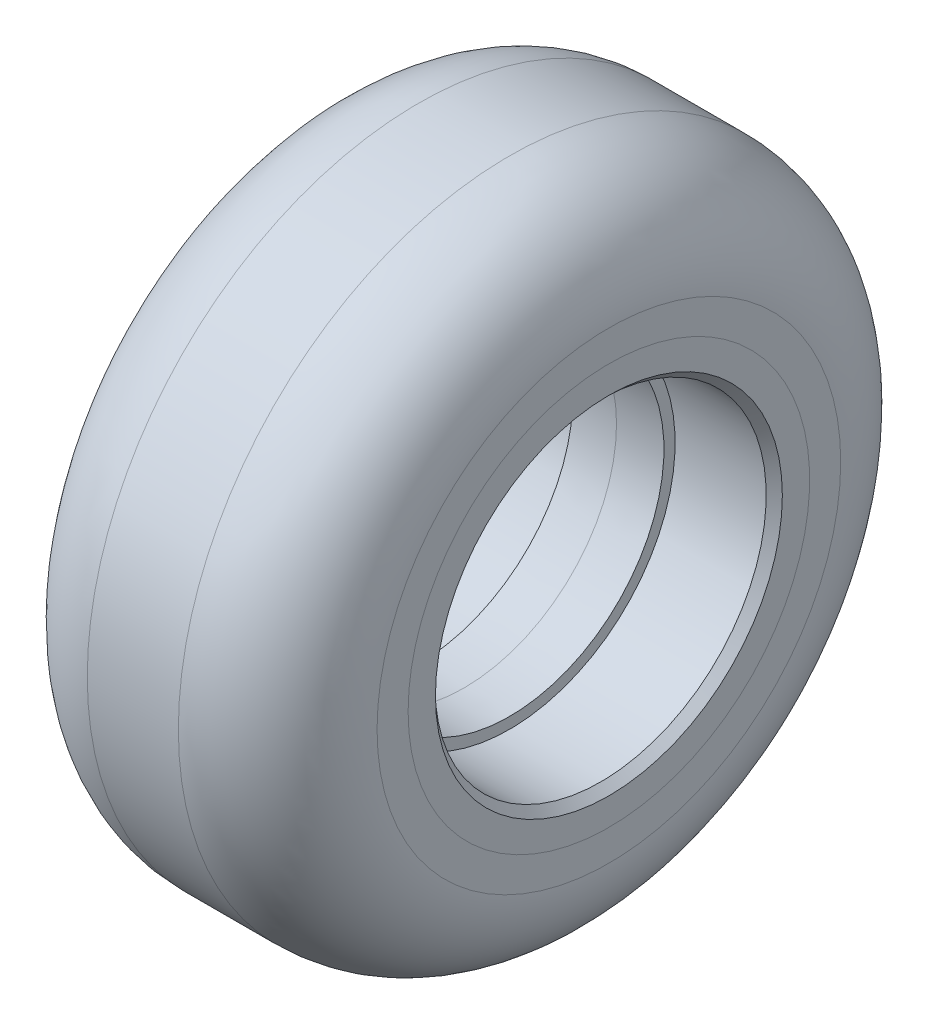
ISO-10303-21;
HEADER;
FILE_DESCRIPTION(('STEP AP214'),'2;1');
FILE_NAME('part.step','',(''),(''),'','','');
FILE_SCHEMA(('AUTOMOTIVE_DESIGN { 1 0 10303 214 1 1 1 1 }'));
ENDSEC;
DATA;
#1=APPLICATION_CONTEXT('core data for automotive mechanical design processes');
#2=APPLICATION_PROTOCOL_DEFINITION('international standard','automotive_design',2000,#1);
#3=PRODUCT_CONTEXT('',#1,'mechanical');
#4=PRODUCT('Part','Part','',(#3));
#5=PRODUCT_RELATED_PRODUCT_CATEGORY('part','',(#4));
#6=PRODUCT_DEFINITION_FORMATION('','',#4);
#7=PRODUCT_DEFINITION_CONTEXT('part definition',#1,'design');
#8=PRODUCT_DEFINITION('design','',#6,#7);
#9=PRODUCT_DEFINITION_SHAPE('','',#8);
#10=(LENGTH_UNIT() NAMED_UNIT(*) SI_UNIT(.MILLI.,.METRE.));
#11=(NAMED_UNIT(*) PLANE_ANGLE_UNIT() SI_UNIT($,.RADIAN.));
#12=(NAMED_UNIT(*) SI_UNIT($,.STERADIAN.) SOLID_ANGLE_UNIT());
#13=UNCERTAINTY_MEASURE_WITH_UNIT(LENGTH_MEASURE(1.E-05),#10,'distance_accuracy_value','');
#14=(GEOMETRIC_REPRESENTATION_CONTEXT(3) GLOBAL_UNCERTAINTY_ASSIGNED_CONTEXT((#13)) GLOBAL_UNIT_ASSIGNED_CONTEXT((#10,
#11,#12)) REPRESENTATION_CONTEXT('',''));
#15=CARTESIAN_POINT('',(0.,0.,0.));
#16=DIRECTION('',(0.,0.,1.));
#17=DIRECTION('',(1.,0.,0.));
#18=AXIS2_PLACEMENT_3D('',#15,#16,#17);
#19=CARTESIAN_POINT('',(-5.50000000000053,0.,0.));
#20=DIRECTION('',(-1.,0.,0.));
#21=DIRECTION('',(0.,0.,1.));
#22=AXIS2_PLACEMENT_3D('',#19,#20,#21);
#23=TOROIDAL_SURFACE('',#22,28.,12.);
#24=CARTESIAN_POINT('',(-17.5000000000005,0.,-1.014197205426E-13));
#25=DIRECTION('',(-1.,0.,0.));
#26=DIRECTION('',(0.,0.,1.));
#27=AXIS2_PLACEMENT_3D('',#24,#25,#26);
#28=CIRCLE('',#27,28.);
#29=CARTESIAN_POINT('',(-17.5000000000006,0.,27.9999999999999));
#30=VERTEX_POINT('',#29);
#31=EDGE_CURVE('E11',#30,#30,#28,.T.);
#32=ORIENTED_EDGE('',*,*,#31,.F.);
#33=EDGE_LOOP('',(#32));
#34=FACE_BOUND('',#33,.T.);
#35=CARTESIAN_POINT('',(-5.50000000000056,0.,0.));
#36=DIRECTION('',(-1.,0.,0.));
#37=DIRECTION('',(0.,0.,1.));
#38=AXIS2_PLACEMENT_3D('',#35,#36,#37);
#39=CIRCLE('',#38,40.);
#40=CARTESIAN_POINT('',(-5.50000000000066,0.,40.));
#41=VERTEX_POINT('',#40);
#42=EDGE_CURVE('E70',#41,#41,#39,.T.);
#43=ORIENTED_EDGE('',*,*,#42,.T.);
#44=EDGE_LOOP('',(#43));
#45=FACE_BOUND('',#44,.T.);
#46=ADVANCED_FACE('F45',(#34,#45),#23,.T.);
#47=CARTESIAN_POINT('',(-17.5000000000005,0.,-24.25));
#48=DIRECTION('',(1.,0.,0.));
#49=DIRECTION('',(0.,0.,-1.));
#50=AXIS2_PLACEMENT_3D('',#47,#48,#49);
#51=PLANE('',#50);
#52=CARTESIAN_POINT('',(-17.5000000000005,0.,-1.014197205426E-13));
#53=DIRECTION('',(-1.,0.,0.));
#54=DIRECTION('',(0.,0.,1.));
#55=AXIS2_PLACEMENT_3D('',#52,#53,#54);
#56=CIRCLE('',#55,24.2499999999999);
#57=CARTESIAN_POINT('',(-17.5000000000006,0.,24.2499999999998));
#58=VERTEX_POINT('',#57);
#59=EDGE_CURVE('E51',#58,#58,#56,.T.);
#60=ORIENTED_EDGE('',*,*,#59,.F.);
#61=EDGE_LOOP('',(#60));
#62=FACE_BOUND('',#61,.T.);
#63=ORIENTED_EDGE('',*,*,#31,.T.);
#64=EDGE_LOOP('',(#63));
#65=FACE_BOUND('',#64,.T.);
#66=ADVANCED_FACE('F101',(#62,#65),#51,.F.);
#67=CARTESIAN_POINT('',(-17.5000000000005,0.,-1.014197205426E-13));
#68=DIRECTION('',(1.,0.,0.));
#69=DIRECTION('',(0.,0.,-1.));
#70=AXIS2_PLACEMENT_3D('',#67,#68,#69);
#71=CONICAL_SURFACE('',#70,24.2499999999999,0.0428309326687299);
#72=CARTESIAN_POINT('',(-5.16947595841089E-13,0.,0.));
#73=DIRECTION('',(-1.,0.,0.));
#74=DIRECTION('',(0.,0.,1.));
#75=AXIS2_PLACEMENT_3D('',#72,#73,#74);
#76=CIRCLE('',#75,24.9999999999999);
#77=CARTESIAN_POINT('',(-5.80628026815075E-13,0.,24.9999999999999));
#78=VERTEX_POINT('',#77);
#79=EDGE_CURVE('E55',#78,#78,#76,.T.);
#80=ORIENTED_EDGE('',*,*,#79,.F.);
#81=EDGE_LOOP('',(#80));
#82=FACE_BOUND('',#81,.T.);
#83=ORIENTED_EDGE('',*,*,#59,.T.);
#84=EDGE_LOOP('',(#83));
#85=FACE_BOUND('',#84,.T.);
#86=ADVANCED_FACE('F96',(#82,#85),#71,.F.);
#87=CARTESIAN_POINT('',(-5.16947595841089E-13,0.,0.));
#88=DIRECTION('',(-1.,0.,0.));
#89=DIRECTION('',(0.,0.,1.));
#90=AXIS2_PLACEMENT_3D('',#87,#88,#89);
#91=CONICAL_SURFACE('',#90,24.9999999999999,0.042830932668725);
#92=CARTESIAN_POINT('',(17.4999999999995,0.,0.));
#93=DIRECTION('',(-1.,0.,0.));
#94=DIRECTION('',(0.,0.,1.));
#95=AXIS2_PLACEMENT_3D('',#92,#93,#94);
#96=CIRCLE('',#95,24.25);
#97=CARTESIAN_POINT('',(17.4999999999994,0.,24.25));
#98=VERTEX_POINT('',#97);
#99=EDGE_CURVE('E59',#98,#98,#96,.T.);
#100=ORIENTED_EDGE('',*,*,#99,.F.);
#101=EDGE_LOOP('',(#100));
#102=FACE_BOUND('',#101,.T.);
#103=ORIENTED_EDGE('',*,*,#79,.T.);
#104=EDGE_LOOP('',(#103));
#105=FACE_BOUND('',#104,.T.);
#106=ADVANCED_FACE('F90',(#102,#105),#91,.F.);
#107=CARTESIAN_POINT('',(17.4999999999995,0.,-24.25));
#108=DIRECTION('',(-1.,0.,0.));
#109=DIRECTION('',(0.,0.,1.));
#110=AXIS2_PLACEMENT_3D('',#107,#108,#109);
#111=PLANE('',#110);
#112=CARTESIAN_POINT('',(17.4999999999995,0.,0.));
#113=DIRECTION('',(-1.,0.,0.));
#114=DIRECTION('',(0.,0.,1.));
#115=AXIS2_PLACEMENT_3D('',#112,#113,#114);
#116=CIRCLE('',#115,28.0000000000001);
#117=CARTESIAN_POINT('',(17.4999999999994,0.,28.0000000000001));
#118=VERTEX_POINT('',#117);
#119=EDGE_CURVE('E64',#118,#118,#116,.T.);
#120=ORIENTED_EDGE('',*,*,#119,.F.);
#121=EDGE_LOOP('',(#120));
#122=FACE_BOUND('',#121,.T.);
#123=ORIENTED_EDGE('',*,*,#99,.T.);
#124=EDGE_LOOP('',(#123));
#125=FACE_BOUND('',#124,.T.);
#126=ADVANCED_FACE('F84',(#122,#125),#111,.F.);
#127=CARTESIAN_POINT('',(5.49999999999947,0.,0.));
#128=DIRECTION('',(-1.,0.,0.));
#129=DIRECTION('',(0.,0.,1.));
#130=AXIS2_PLACEMENT_3D('',#127,#128,#129);
#131=TOROIDAL_SURFACE('',#130,28.0000000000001,12.);
#132=CARTESIAN_POINT('',(5.49999999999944,0.,0.));
#133=DIRECTION('',(-1.,0.,0.));
#134=DIRECTION('',(0.,0.,1.));
#135=AXIS2_PLACEMENT_3D('',#132,#133,#134);
#136=CIRCLE('',#135,40.0000000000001);
#137=CARTESIAN_POINT('',(5.49999999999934,0.,40.));
#138=VERTEX_POINT('',#137);
#139=EDGE_CURVE('E67',#138,#138,#136,.T.);
#140=ORIENTED_EDGE('',*,*,#139,.F.);
#141=EDGE_LOOP('',(#140));
#142=FACE_BOUND('',#141,.T.);
#143=ORIENTED_EDGE('',*,*,#119,.T.);
#144=EDGE_LOOP('',(#143));
#145=FACE_BOUND('',#144,.T.);
#146=ADVANCED_FACE('F78',(#142,#145),#131,.T.);
#147=CARTESIAN_POINT('',(-22.3158896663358,0.,-1.13686837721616E-13));
#148=DIRECTION('',(-1.,0.,0.));
#149=DIRECTION('',(0.,0.,1.));
#150=AXIS2_PLACEMENT_3D('',#147,#148,#149);
#151=CYLINDRICAL_SURFACE('',#150,40.0000000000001);
#152=ORIENTED_EDGE('',*,*,#42,.F.);
#153=EDGE_LOOP('',(#152));
#154=FACE_BOUND('',#153,.T.);
#155=ORIENTED_EDGE('',*,*,#139,.T.);
#156=EDGE_LOOP('',(#155));
#157=FACE_BOUND('',#156,.T.);
#158=ADVANCED_FACE('F75',(#154,#157),#151,.T.);
#159=CLOSED_SHELL('',(#46,#66,#86,#106,#126,#146,#158));
#160=MANIFOLD_SOLID_BREP('B2',#159);
#161=CARTESIAN_POINT('',(-5.16947595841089E-13,0.,0.));
#162=DIRECTION('',(1.,0.,0.));
#163=DIRECTION('',(0.,0.,-1.));
#164=AXIS2_PLACEMENT_3D('',#161,#162,#163);
#165=CONICAL_SURFACE('',#164,24.9999999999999,0.0428309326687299);
#166=CARTESIAN_POINT('',(-17.5000000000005,0.,-1.014197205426E-13));
#167=DIRECTION('',(-1.,0.,0.));
#168=DIRECTION('',(0.,0.,1.));
#169=AXIS2_PLACEMENT_3D('',#166,#167,#168);
#170=CIRCLE('',#169,24.2499999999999);
#171=CARTESIAN_POINT('',(-17.5000000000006,0.,24.2499999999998));
#172=VERTEX_POINT('',#171);
#173=EDGE_CURVE('E44',#172,#172,#170,.T.);
#174=ORIENTED_EDGE('',*,*,#173,.F.);
#175=EDGE_LOOP('',(#174));
#176=FACE_BOUND('',#175,.T.);
#177=CARTESIAN_POINT('',(-5.16947595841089E-13,0.,0.));
#178=DIRECTION('',(-1.,0.,0.));
#179=DIRECTION('',(0.,0.,1.));
#180=AXIS2_PLACEMENT_3D('',#177,#178,#179);
#181=CIRCLE('',#180,24.9999999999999);
#182=CARTESIAN_POINT('',(-5.80628026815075E-13,0.,24.9999999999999));
#183=VERTEX_POINT('',#182);
#184=EDGE_CURVE('E192',#183,#183,#181,.T.);
#185=ORIENTED_EDGE('',*,*,#184,.T.);
#186=EDGE_LOOP('',(#185));
#187=FACE_BOUND('',#186,.T.);
#188=ADVANCED_FACE('F152',(#176,#187),#165,.T.);
#189=CARTESIAN_POINT('',(-17.5000000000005,0.,-24.25));
#190=DIRECTION('',(1.,0.,0.));
#191=DIRECTION('',(0.,0.,-1.));
#192=AXIS2_PLACEMENT_3D('',#189,#190,#191);
#193=PLANE('',#192);
#194=CARTESIAN_POINT('',(-17.5000000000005,0.,-1.014197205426E-13));
#195=DIRECTION('',(-1.,0.,0.));
#196=DIRECTION('',(0.,0.,1.));
#197=AXIS2_PLACEMENT_3D('',#194,#195,#196);
#198=CIRCLE('',#197,20.9499999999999);
#199=CARTESIAN_POINT('',(-17.5000000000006,0.,20.9499999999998));
#200=VERTEX_POINT('',#199);
#201=EDGE_CURVE('E158',#200,#200,#198,.T.);
#202=ORIENTED_EDGE('',*,*,#201,.F.);
#203=EDGE_LOOP('',(#202));
#204=FACE_BOUND('',#203,.T.);
#205=ORIENTED_EDGE('',*,*,#173,.T.);
#206=EDGE_LOOP('',(#205));
#207=FACE_BOUND('',#206,.T.);
#208=ADVANCED_FACE('F253',(#204,#207),#193,.F.);
#209=CARTESIAN_POINT('',(-17.5000000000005,0.,-1.014197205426E-13));
#210=DIRECTION('',(-1.,0.,0.));
#211=DIRECTION('',(0.,0.,1.));
#212=AXIS2_PLACEMENT_3D('',#209,#210,#211);
#213=CONICAL_SURFACE('',#212,20.9499999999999,0.759762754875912);
#214=CARTESIAN_POINT('',(-16.5000000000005,0.,0.));
#215=DIRECTION('',(-1.,0.,0.));
#216=DIRECTION('',(0.,0.,1.));
#217=AXIS2_PLACEMENT_3D('',#214,#215,#216);
#218=CIRCLE('',#217,19.9999999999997);
#219=CARTESIAN_POINT('',(-16.5000000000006,0.,19.9999999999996));
#220=VERTEX_POINT('',#219);
#221=EDGE_CURVE('E162',#220,#220,#218,.T.);
#222=ORIENTED_EDGE('',*,*,#221,.F.);
#223=EDGE_LOOP('',(#222));
#224=FACE_BOUND('',#223,.T.);
#225=ORIENTED_EDGE('',*,*,#201,.T.);
#226=EDGE_LOOP('',(#225));
#227=FACE_BOUND('',#226,.T.);
#228=ADVANCED_FACE('F248',(#224,#227),#213,.F.);
#229=CARTESIAN_POINT('',(-22.3158896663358,0.,-1.13686837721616E-13));
#230=DIRECTION('',(-1.,0.,0.));
#231=DIRECTION('',(0.,0.,1.));
#232=AXIS2_PLACEMENT_3D('',#229,#230,#231);
#233=CYLINDRICAL_SURFACE('',#232,19.9999999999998);
#234=CARTESIAN_POINT('',(-5.50000000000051,0.,0.));
#235=DIRECTION('',(-1.,0.,0.));
#236=DIRECTION('',(0.,0.,1.));
#237=AXIS2_PLACEMENT_3D('',#234,#235,#236);
#238=CIRCLE('',#237,19.9999999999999);
#239=CARTESIAN_POINT('',(-5.50000000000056,0.,19.9999999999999));
#240=VERTEX_POINT('',#239);
#241=EDGE_CURVE('E166',#240,#240,#238,.T.);
#242=ORIENTED_EDGE('',*,*,#241,.F.);
#243=EDGE_LOOP('',(#242));
#244=FACE_BOUND('',#243,.T.);
#245=ORIENTED_EDGE('',*,*,#221,.T.);
#246=EDGE_LOOP('',(#245));
#247=FACE_BOUND('',#246,.T.);
#248=ADVANCED_FACE('F242',(#244,#247),#233,.F.);
#249=CARTESIAN_POINT('',(-5.50000000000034,0.,-20.));
#250=DIRECTION('',(1.,0.,0.));
#251=DIRECTION('',(0.,0.,-1.));
#252=AXIS2_PLACEMENT_3D('',#249,#250,#251);
#253=PLANE('',#252);
#254=CARTESIAN_POINT('',(-5.50000000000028,0.,0.));
#255=DIRECTION('',(-1.,0.,0.));
#256=DIRECTION('',(0.,0.,1.));
#257=AXIS2_PLACEMENT_3D('',#254,#255,#256);
#258=CIRCLE('',#257,18.6499999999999);
#259=CARTESIAN_POINT('',(-5.50000000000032,0.,18.6499999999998));
#260=VERTEX_POINT('',#259);
#261=EDGE_CURVE('E171',#260,#260,#258,.T.);
#262=ORIENTED_EDGE('',*,*,#261,.F.);
#263=EDGE_LOOP('',(#262));
#264=FACE_BOUND('',#263,.T.);
#265=ORIENTED_EDGE('',*,*,#241,.T.);
#266=EDGE_LOOP('',(#265));
#267=FACE_BOUND('',#266,.T.);
#268=ADVANCED_FACE('F236',(#264,#267),#253,.F.);
#269=CARTESIAN_POINT('',(-5.50000000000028,0.,0.));
#270=DIRECTION('',(-1.,0.,0.));
#271=DIRECTION('',(0.,0.,1.));
#272=AXIS2_PLACEMENT_3D('',#269,#270,#271);
#273=CONICAL_SURFACE('',#272,18.6499999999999,0.0416425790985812);
#274=CARTESIAN_POINT('',(-5.03069808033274E-13,0.,0.));
#275=DIRECTION('',(-1.,0.,0.));
#276=DIRECTION('',(0.,0.,1.));
#277=AXIS2_PLACEMENT_3D('',#274,#275,#276);
#278=CIRCLE('',#277,18.4208333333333);
#279=CARTESIAN_POINT('',(-5.4999167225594E-13,0.,18.4208333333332));
#280=VERTEX_POINT('',#279);
#281=EDGE_CURVE('E174',#280,#280,#278,.T.);
#282=ORIENTED_EDGE('',*,*,#281,.F.);
#283=EDGE_LOOP('',(#282));
#284=FACE_BOUND('',#283,.T.);
#285=ORIENTED_EDGE('',*,*,#261,.T.);
#286=EDGE_LOOP('',(#285));
#287=FACE_BOUND('',#286,.T.);
#288=ADVANCED_FACE('F230',(#284,#287),#273,.F.);
#289=CARTESIAN_POINT('',(-5.03069808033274E-13,0.,0.));
#290=DIRECTION('',(1.,0.,0.));
#291=DIRECTION('',(0.,0.,-1.));
#292=AXIS2_PLACEMENT_3D('',#289,#290,#291);
#293=CONICAL_SURFACE('',#292,18.4208333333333,0.0416425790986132);
#294=CARTESIAN_POINT('',(5.49999999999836,0.,0.));
#295=DIRECTION('',(-1.,0.,0.));
#296=DIRECTION('',(0.,0.,1.));
#297=AXIS2_PLACEMENT_3D('',#294,#295,#296);
#298=CIRCLE('',#297,18.65);
#299=CARTESIAN_POINT('',(5.49999999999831,0.,18.65));
#300=VERTEX_POINT('',#299);
#301=EDGE_CURVE('E177',#300,#300,#298,.T.);
#302=ORIENTED_EDGE('',*,*,#301,.F.);
#303=EDGE_LOOP('',(#302));
#304=FACE_BOUND('',#303,.T.);
#305=ORIENTED_EDGE('',*,*,#281,.T.);
#306=EDGE_LOOP('',(#305));
#307=FACE_BOUND('',#306,.T.);
#308=ADVANCED_FACE('F224',(#304,#307),#293,.F.);
#309=CARTESIAN_POINT('',(5.49999999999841,0.,-19.9999999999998));
#310=DIRECTION('',(-1.,0.,0.));
#311=DIRECTION('',(0.,0.,1.));
#312=AXIS2_PLACEMENT_3D('',#309,#310,#311);
#313=PLANE('',#312);
#314=CARTESIAN_POINT('',(5.49999999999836,0.,0.));
#315=DIRECTION('',(-1.,0.,0.));
#316=DIRECTION('',(0.,0.,1.));
#317=AXIS2_PLACEMENT_3D('',#314,#315,#316);
#318=CIRCLE('',#317,19.9999999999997);
#319=CARTESIAN_POINT('',(5.49999999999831,0.,19.9999999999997));
#320=VERTEX_POINT('',#319);
#321=EDGE_CURVE('E180',#320,#320,#318,.T.);
#322=ORIENTED_EDGE('',*,*,#321,.F.);
#323=EDGE_LOOP('',(#322));
#324=FACE_BOUND('',#323,.T.);
#325=ORIENTED_EDGE('',*,*,#301,.T.);
#326=EDGE_LOOP('',(#325));
#327=FACE_BOUND('',#326,.T.);
#328=ADVANCED_FACE('F218',(#324,#327),#313,.F.);
#329=CARTESIAN_POINT('',(-22.3158896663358,0.,-1.13686837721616E-13));
#330=DIRECTION('',(-1.,0.,0.));
#331=DIRECTION('',(0.,0.,1.));
#332=AXIS2_PLACEMENT_3D('',#329,#330,#331);
#333=CYLINDRICAL_SURFACE('',#332,19.9999999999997);
#334=CARTESIAN_POINT('',(16.4999999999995,0.,0.));
#335=DIRECTION('',(-1.,0.,0.));
#336=DIRECTION('',(0.,0.,1.));
#337=AXIS2_PLACEMENT_3D('',#334,#335,#336);
#338=CIRCLE('',#337,19.9999999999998);
#339=CARTESIAN_POINT('',(16.4999999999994,0.,19.9999999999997));
#340=VERTEX_POINT('',#339);
#341=EDGE_CURVE('E183',#340,#340,#338,.T.);
#342=ORIENTED_EDGE('',*,*,#341,.F.);
#343=EDGE_LOOP('',(#342));
#344=FACE_BOUND('',#343,.T.);
#345=ORIENTED_EDGE('',*,*,#321,.T.);
#346=EDGE_LOOP('',(#345));
#347=FACE_BOUND('',#346,.T.);
#348=ADVANCED_FACE('F212',(#344,#347),#333,.F.);
#349=CARTESIAN_POINT('',(16.4999999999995,0.,0.));
#350=DIRECTION('',(1.,0.,0.));
#351=DIRECTION('',(0.,0.,-1.));
#352=AXIS2_PLACEMENT_3D('',#349,#350,#351);
#353=CONICAL_SURFACE('',#352,19.9999999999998,0.759762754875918);
#354=CARTESIAN_POINT('',(17.4999999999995,0.,0.));
#355=DIRECTION('',(-1.,0.,0.));
#356=DIRECTION('',(0.,0.,1.));
#357=AXIS2_PLACEMENT_3D('',#354,#355,#356);
#358=CIRCLE('',#357,20.95);
#359=CARTESIAN_POINT('',(17.4999999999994,0.,20.95));
#360=VERTEX_POINT('',#359);
#361=EDGE_CURVE('E186',#360,#360,#358,.T.);
#362=ORIENTED_EDGE('',*,*,#361,.F.);
#363=EDGE_LOOP('',(#362));
#364=FACE_BOUND('',#363,.T.);
#365=ORIENTED_EDGE('',*,*,#341,.T.);
#366=EDGE_LOOP('',(#365));
#367=FACE_BOUND('',#366,.T.);
#368=ADVANCED_FACE('F206',(#364,#367),#353,.F.);
#369=CARTESIAN_POINT('',(17.4999999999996,0.,-24.25));
#370=DIRECTION('',(-1.,0.,0.));
#371=DIRECTION('',(0.,0.,1.));
#372=AXIS2_PLACEMENT_3D('',#369,#370,#371);
#373=PLANE('',#372);
#374=CARTESIAN_POINT('',(17.4999999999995,0.,0.));
#375=DIRECTION('',(-1.,0.,0.));
#376=DIRECTION('',(0.,0.,1.));
#377=AXIS2_PLACEMENT_3D('',#374,#375,#376);
#378=CIRCLE('',#377,24.25);
#379=CARTESIAN_POINT('',(17.4999999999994,0.,24.25));
#380=VERTEX_POINT('',#379);
#381=EDGE_CURVE('E189',#380,#380,#378,.T.);
#382=ORIENTED_EDGE('',*,*,#381,.F.);
#383=EDGE_LOOP('',(#382));
#384=FACE_BOUND('',#383,.T.);
#385=ORIENTED_EDGE('',*,*,#361,.T.);
#386=EDGE_LOOP('',(#385));
#387=FACE_BOUND('',#386,.T.);
#388=ADVANCED_FACE('F200',(#384,#387),#373,.F.);
#389=CARTESIAN_POINT('',(17.4999999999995,0.,0.));
#390=DIRECTION('',(-1.,0.,0.));
#391=DIRECTION('',(0.,0.,1.));
#392=AXIS2_PLACEMENT_3D('',#389,#390,#391);
#393=CONICAL_SURFACE('',#392,24.25,0.042830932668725);
#394=ORIENTED_EDGE('',*,*,#184,.F.);
#395=EDGE_LOOP('',(#394));
#396=FACE_BOUND('',#395,.T.);
#397=ORIENTED_EDGE('',*,*,#381,.T.);
#398=EDGE_LOOP('',(#397));
#399=FACE_BOUND('',#398,.T.);
#400=ADVANCED_FACE('F197',(#396,#399),#393,.T.);
#401=CLOSED_SHELL('',(#188,#208,#228,#248,#268,#288,#308,#328,#348,#368,#388,#400));
#402=MANIFOLD_SOLID_BREP('B6',#401);
#403=ADVANCED_BREP_SHAPE_REPRESENTATION('',(#18,#160,#402),#14);
#404=SHAPE_DEFINITION_REPRESENTATION(#9,#403);
ENDSEC;
END-ISO-10303-21;
